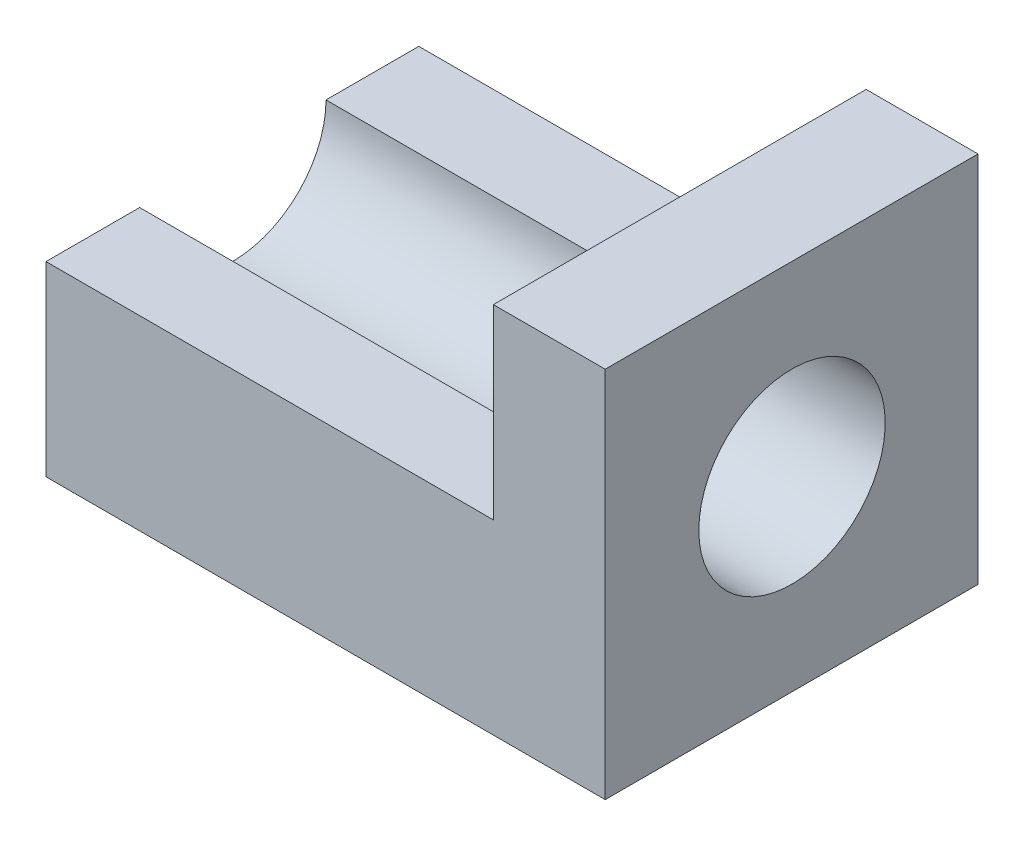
from build123d import *

# Parameters (mm, degrees)
EXTRUDE_1_DEPTH = 150
EXTRUDE_START   = -30
EXTRUDE_2_DEPTH = 30


with BuildPart() as part:
    # Sketch 1 → Extrude 1 (new body)
    with BuildSketch(Plane(origin=(0, 0, 0), x_dir=(0, 0, -1), z_dir=(1, 0, 0))):
        with BuildLine():
            Line((-50, 0), (50, 0))
            Line((50, 0), (50, 50))
            Line((50, 50), (25.11091954, 50))
            ThreePointArc((25.11091954, 50), (0.11091954, 25), (-24.88908046, 50))
            Line((-24.88908046, 50), (-50, 50))
            Line((-50, 50), (-50, 0))
        make_face()
    extrude(amount=EXTRUDE_1_DEPTH)

    # Sketch 2 → Extrude 2 (add)
    with BuildSketch(Plane(origin=(150, 0, 0), x_dir=(0, 0, -1), z_dir=(1, 0, 0)).offset(EXTRUDE_START)):
        with BuildLine():
            Line((50, 50), (50, 100))
            Line((50, 100), (-50, 100))
            Line((-50, 100), (-50, 50))
            Line((-50, 50), (-24.88908046, 50))
            ThreePointArc((-24.88908046, 50), (0.11091954, 75), (25.11091954, 50))
            Line((25.11091954, 50), (50, 50))
        make_face()
    extrude(amount=EXTRUDE_2_DEPTH)


solid = part.part
